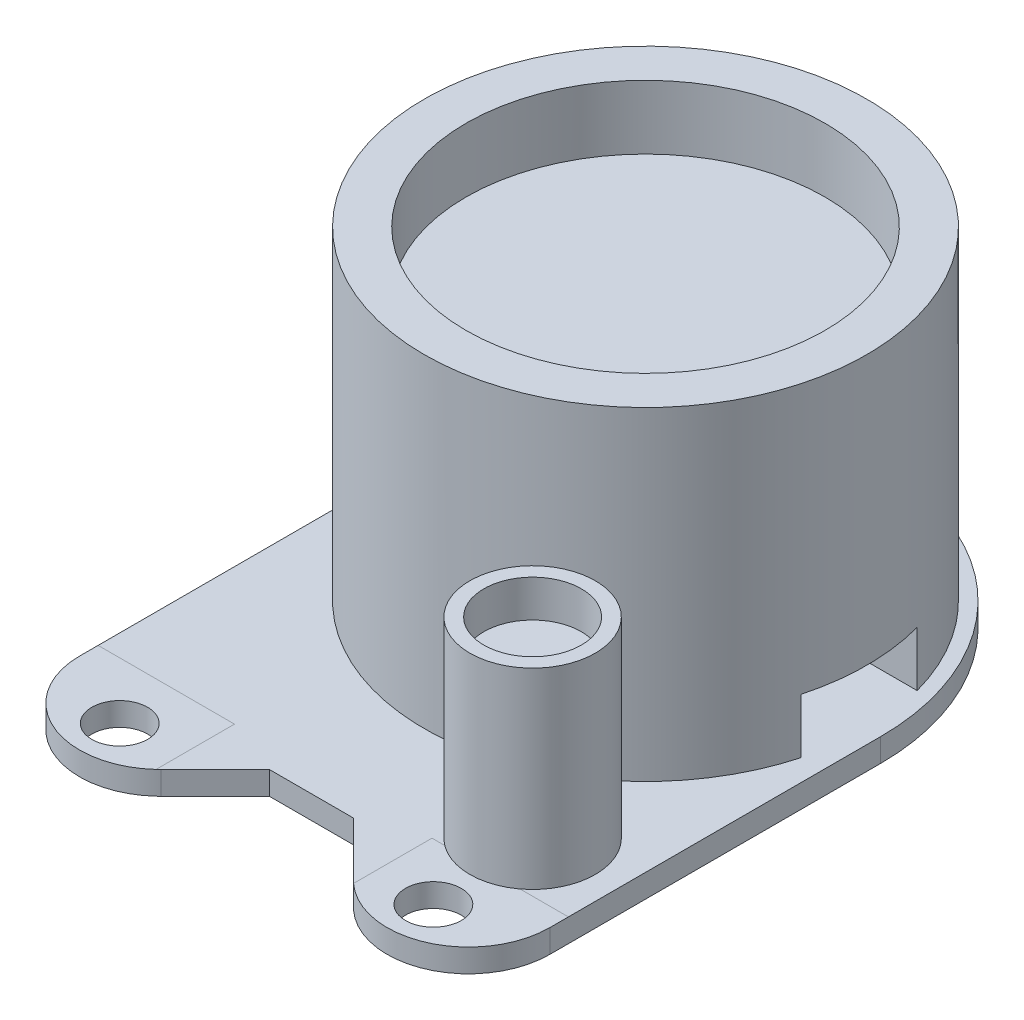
from build123d import *

# Parameters (mm, degrees)
SKETCH1_R               = 1.2
BOSS_EXTRUDE1_DEPTH     = 1
SKETCH4_R               = 9.525
SKETCH4_R_2             = 7.725
BOSS_EXTRUDE2_DEPTH     = 13.94
CUT_EXTRUDE1_DEPTH      = 26.304655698
CUT_EXTRUDE1_DEPTH_BACK = 26.304655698
SKETCH5_W               = 5
SKETCH5_H               = 2.36
BOSS_EXTRUDE3_START     = -2.75
SKETCH6_R               = 7.725
BOSS_EXTRUDE3_DEPTH     = 8.83
SKETCH7_R               = 2.7
SKETCH7_R_2             = 2.1
EXTRUDE_THIN1_DEPTH     = 8.25
BOSS_EXTRUDE4_START     = -1.6
SKETCH8_R               = 2.1
BOSS_EXTRUDE4_DEPTH     = 6.65
SKETCH9_R               = 4
CUT_EXTRUDE2_DEPTH      = 6.45
FILLET1_R               = 4
BOSS_EXTRUDE5_DEPTH     = 2.36


with BuildPart() as part:
    # Sketch1 → Boss-Extrude1 (new body)
    with BuildSketch(Plane(origin=(0, 0, 0), x_dir=(1, 0, 0), z_dir=(0, 1, 0))):
        with BuildLine():
            Line((-10.12, 0), (-10.12, -14.24))
            ThreePointArc((-10.12, -14.24), (-7.959392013, -17.473578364), (-4.145126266, -16.714873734))
            Line((-4.145126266, -16.714873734), (-1.810252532, -14.38))
            Line((-1.810252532, -14.38), (1.810252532, -14.38))
            Line((1.810252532, -14.38), (4.145126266, -16.714873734))
            ThreePointArc((4.145126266, -16.714873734), (7.959392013, -17.473578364), (10.12, -14.24))
            Line((10.12, -14.24), (10.12, 0))
            ThreePointArc((10.12, 0), (0, 10.12), (-10.12, 0))
        make_face()
        with Locations(Location((-6.75, -15.88, 0), (0, 0, 270))):
            Circle(SKETCH1_R, mode=Mode.SUBTRACT)
        with Locations(Location((6.75, -15.88, 0), (0, 0, 90))):
            Circle(SKETCH1_R, mode=Mode.SUBTRACT)
    extrude(amount=BOSS_EXTRUDE1_DEPTH)


with BuildPart() as body_2:
    # Sketch4 → Boss-Extrude2 (new body)
    with BuildSketch(Plane(origin=(0, 1, 0), x_dir=(1, 0, 0), z_dir=(0, 1, 0))):
        with Locations(Location((0, 0, 0), (0, 0, 90))):
            Circle(SKETCH4_R)
        with Locations(Location((0, 0, 0), (0, 0, 90))):
            Circle(SKETCH4_R_2, mode=Mode.SUBTRACT)
    extrude(amount=BOSS_EXTRUDE2_DEPTH)

    # Sketch5 → Cut-Extrude1 (cut, two sides: drawn at the far end of the back side and taken through both)
    with BuildSketch(Plane(origin=(0, 0, 0), x_dir=(0, 0, -1), z_dir=(1, 0, 0)).offset(-CUT_EXTRUDE1_DEPTH_BACK)):
        with Locations((0, 2.18)):
            Rectangle(SKETCH5_W, SKETCH5_H)
    extrude(amount=CUT_EXTRUDE1_DEPTH + CUT_EXTRUDE1_DEPTH_BACK, mode=Mode.SUBTRACT)

    # Sketch10 → Boss-Extrude5 (add)
    with BuildSketch(Plane.XZ.offset(-1)):
        with BuildLine():
            Line((-7.309283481, -2.5), (-3.122498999, -2.5))
            ThreePointArc((-3.122498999, -2.5), (0, -4), (3.122498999, -2.5))
            Line((3.122498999, -2.5), (7.309283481, -2.5))
            ThreePointArc((7.309283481, -2.5), (0, -7.725), (-7.309283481, -2.5))
        make_face()
        with BuildLine():
            Line((-7.309283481, 2.5), (-3.122498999, 2.5))
            ThreePointArc((-3.122498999, 2.5), (0, 4), (3.122498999, 2.5))
            Line((3.122498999, 2.5), (7.309283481, 2.5))
            ThreePointArc((7.309283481, 2.5), (0, 7.725), (-7.309283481, 2.5))
        make_face()
    extrude(amount=-BOSS_EXTRUDE5_DEPTH)


with BuildPart() as body_3:
    # Sketch6 → Boss-Extrude3 (new body)
    with BuildSketch(Plane(origin=(0, 14.94, 0), x_dir=(1, 0, 0), z_dir=(0, 1, 0)).offset(BOSS_EXTRUDE3_START)):
        with Locations(Location((0, 0, 0), (0, 0, 270))):
            Circle(SKETCH6_R)
    extrude(amount=-BOSS_EXTRUDE3_DEPTH)

    # Sketch9 → Cut-Extrude2 (cut)
    with BuildSketch(Plane.XZ.offset(-1)):
        with Locations(Location((0, 0, 0), (0, 0, 270))):
            Circle(SKETCH9_R)
    extrude(amount=-CUT_EXTRUDE2_DEPTH, mode=Mode.SUBTRACT)

    # Fillet1
    fillet1_edges = [body_3.edges().sort_by_distance(p)[0] for p in [
        (0, 7.45, 4),
    ]]
    fillet(fillet1_edges, radius=FILLET1_R)


with BuildPart() as body_4:
    # Sketch7 → Extrude-Thin1 (new body)
    with BuildSketch(Plane(origin=(0, 1, 0), x_dir=(1, 0, 0), z_dir=(0, 1, 0))):
        with Locations((6.42, -11.28)):
            Circle(SKETCH7_R)
        with Locations((6.42, -11.28)):
            Circle(SKETCH7_R_2, mode=Mode.SUBTRACT)
    extrude(amount=EXTRUDE_THIN1_DEPTH)

    # Sketch8 → Boss-Extrude4 (add)
    with BuildSketch(Plane(origin=(0, 9.25, 0), x_dir=(1, 0, 0), z_dir=(0, 1, 0)).offset(BOSS_EXTRUDE4_START)):
        with Locations((6.42, -11.28)):
            Circle(SKETCH8_R)
    extrude(amount=-BOSS_EXTRUDE4_DEPTH)


solid = Compound([part.part, body_2.part, body_3.part, body_4.part])
